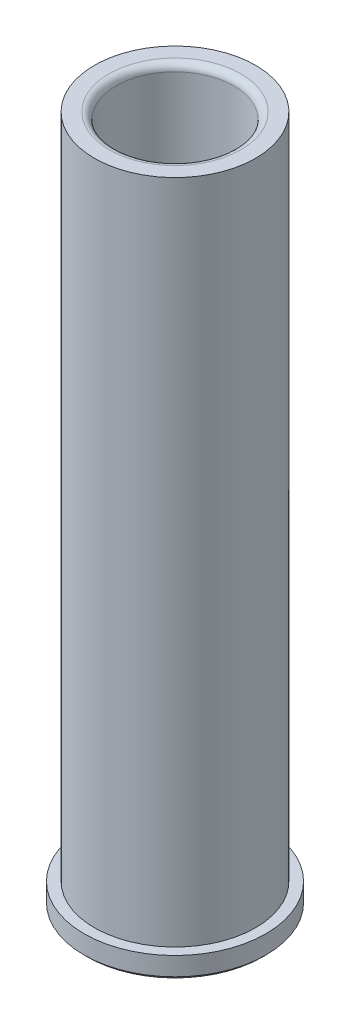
ISO-10303-21;
HEADER;
FILE_DESCRIPTION(('STEP AP214'),'2;1');
FILE_NAME('part.step','',(''),(''),'','','');
FILE_SCHEMA(('AUTOMOTIVE_DESIGN { 1 0 10303 214 1 1 1 1 }'));
ENDSEC;
DATA;
#1=APPLICATION_CONTEXT('core data for automotive mechanical design processes');
#2=APPLICATION_PROTOCOL_DEFINITION('international standard','automotive_design',2000,#1);
#3=PRODUCT_CONTEXT('',#1,'mechanical');
#4=PRODUCT('Part','Part','',(#3));
#5=PRODUCT_RELATED_PRODUCT_CATEGORY('part','',(#4));
#6=PRODUCT_DEFINITION_FORMATION('','',#4);
#7=PRODUCT_DEFINITION_CONTEXT('part definition',#1,'design');
#8=PRODUCT_DEFINITION('design','',#6,#7);
#9=PRODUCT_DEFINITION_SHAPE('','',#8);
#10=(LENGTH_UNIT() NAMED_UNIT(*) SI_UNIT(.MILLI.,.METRE.));
#11=(NAMED_UNIT(*) PLANE_ANGLE_UNIT() SI_UNIT($,.RADIAN.));
#12=(NAMED_UNIT(*) SI_UNIT($,.STERADIAN.) SOLID_ANGLE_UNIT());
#13=UNCERTAINTY_MEASURE_WITH_UNIT(LENGTH_MEASURE(1.E-05),#10,'distance_accuracy_value','');
#14=(GEOMETRIC_REPRESENTATION_CONTEXT(3) GLOBAL_UNCERTAINTY_ASSIGNED_CONTEXT((#13)) GLOBAL_UNIT_ASSIGNED_CONTEXT((#10,
#11,#12)) REPRESENTATION_CONTEXT('',''));
#15=CARTESIAN_POINT('',(0.,0.,0.));
#16=DIRECTION('',(0.,0.,1.));
#17=DIRECTION('',(1.,0.,0.));
#18=AXIS2_PLACEMENT_3D('',#15,#16,#17);
#19=CARTESIAN_POINT('',(3.49148336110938E-12,-1000.,0.));
#20=DIRECTION('',(0.,-1.,0.));
#21=DIRECTION('',(1.,0.,0.));
#22=AXIS2_PLACEMENT_3D('',#19,#20,#21);
#23=CYLINDRICAL_SURFACE('',#22,17.4688499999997);
#24=CARTESIAN_POINT('',(0.,4.7625,0.));
#25=DIRECTION('',(0.,-1.,0.));
#26=DIRECTION('',(1.,0.,0.));
#27=AXIS2_PLACEMENT_3D('',#24,#25,#26);
#28=CIRCLE('',#27,17.46885);
#29=CARTESIAN_POINT('',(17.4688499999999,4.76250000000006,0.));
#30=VERTEX_POINT('',#29);
#31=EDGE_CURVE('E60',#30,#30,#28,.T.);
#32=ORIENTED_EDGE('',*,*,#31,.F.);
#33=EDGE_LOOP('',(#32));
#34=FACE_BOUND('',#33,.T.);
#35=CARTESIAN_POINT('',(-5.21016604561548E-13,149.225,0.));
#36=DIRECTION('',(0.,-1.,0.));
#37=DIRECTION('',(1.,0.,0.));
#38=AXIS2_PLACEMENT_3D('',#35,#36,#37);
#39=CIRCLE('',#38,17.4688499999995);
#40=CARTESIAN_POINT('',(17.468849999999,149.225,0.));
#41=VERTEX_POINT('',#40);
#42=EDGE_CURVE('E39',#41,#41,#39,.T.);
#43=ORIENTED_EDGE('',*,*,#42,.T.);
#44=EDGE_LOOP('',(#43));
#45=FACE_BOUND('',#44,.T.);
#46=ADVANCED_FACE('F28',(#34,#45),#23,.T.);
#47=CARTESIAN_POINT('',(-17.46885,149.225,0.));
#48=DIRECTION('',(0.,-1.,0.));
#49=DIRECTION('',(1.,0.,0.));
#50=AXIS2_PLACEMENT_3D('',#47,#48,#49);
#51=PLANE('',#50);
#52=CARTESIAN_POINT('',(-5.21016604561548E-13,149.225,0.));
#53=DIRECTION('',(0.,-1.,0.));
#54=DIRECTION('',(1.,0.,0.));
#55=AXIS2_PLACEMENT_3D('',#52,#53,#54);
#56=CIRCLE('',#55,14.2874999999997);
#57=CARTESIAN_POINT('',(14.2874999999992,149.225,0.));
#58=VERTEX_POINT('',#57);
#59=EDGE_CURVE('E35',#58,#58,#56,.T.);
#60=ORIENTED_EDGE('',*,*,#59,.T.);
#61=EDGE_LOOP('',(#60));
#62=FACE_BOUND('',#61,.T.);
#63=ORIENTED_EDGE('',*,*,#42,.F.);
#64=EDGE_LOOP('',(#63));
#65=FACE_BOUND('',#64,.T.);
#66=ADVANCED_FACE('F68',(#62,#65),#51,.F.);
#67=CARTESIAN_POINT('',(3.49148336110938E-12,-1000.,0.));
#68=DIRECTION('',(0.,-1.,0.));
#69=DIRECTION('',(1.,0.,0.));
#70=AXIS2_PLACEMENT_3D('',#67,#68,#69);
#71=CYLINDRICAL_SURFACE('',#70,12.7634999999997);
#72=CARTESIAN_POINT('',(-5.15695583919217E-13,147.701,0.));
#73=DIRECTION('',(0.,-1.,0.));
#74=DIRECTION('',(1.,0.,0.));
#75=AXIS2_PLACEMENT_3D('',#72,#73,#74);
#76=CIRCLE('',#75,12.7634999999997);
#77=CARTESIAN_POINT('',(12.7634999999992,147.701,0.));
#78=VERTEX_POINT('',#77);
#79=EDGE_CURVE('E10',#78,#78,#76,.F.);
#80=ORIENTED_EDGE('',*,*,#79,.T.);
#81=EDGE_LOOP('',(#80));
#82=FACE_BOUND('',#81,.T.);
#83=CARTESIAN_POINT('',(0.,0.761999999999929,0.));
#84=DIRECTION('',(0.,-1.,0.));
#85=DIRECTION('',(1.,0.,0.));
#86=AXIS2_PLACEMENT_3D('',#83,#84,#85);
#87=CIRCLE('',#86,12.7635);
#88=CARTESIAN_POINT('',(12.7635,0.761999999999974,0.));
#89=VERTEX_POINT('',#88);
#90=EDGE_CURVE('E43',#89,#89,#87,.T.);
#91=ORIENTED_EDGE('',*,*,#90,.T.);
#92=EDGE_LOOP('',(#91));
#93=FACE_BOUND('',#92,.T.);
#94=ADVANCED_FACE('F72',(#82,#93),#71,.F.);
#95=CARTESIAN_POINT('',(0.,0.,0.));
#96=DIRECTION('',(0.,-1.,0.));
#97=DIRECTION('',(1.,0.,0.));
#98=AXIS2_PLACEMENT_3D('',#95,#96,#97);
#99=CONICAL_SURFACE('',#98,13.5255,0.785398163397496);
#100=ORIENTED_EDGE('',*,*,#90,.F.);
#101=EDGE_LOOP('',(#100));
#102=FACE_BOUND('',#101,.T.);
#103=CARTESIAN_POINT('',(0.,0.,0.));
#104=DIRECTION('',(0.,-1.,0.));
#105=DIRECTION('',(1.,0.,0.));
#106=AXIS2_PLACEMENT_3D('',#103,#104,#105);
#107=CIRCLE('',#106,13.5255);
#108=CARTESIAN_POINT('',(13.5255,0.,0.));
#109=VERTEX_POINT('',#108);
#110=EDGE_CURVE('E48',#109,#109,#107,.T.);
#111=ORIENTED_EDGE('',*,*,#110,.T.);
#112=EDGE_LOOP('',(#111));
#113=FACE_BOUND('',#112,.T.);
#114=ADVANCED_FACE('F77',(#102,#113),#99,.F.);
#115=CARTESIAN_POINT('',(-13.5255,0.,0.));
#116=DIRECTION('',(0.,1.,0.));
#117=DIRECTION('',(-1.,0.,0.));
#118=AXIS2_PLACEMENT_3D('',#115,#116,#117);
#119=PLANE('',#118);
#120=ORIENTED_EDGE('',*,*,#110,.F.);
#121=EDGE_LOOP('',(#120));
#122=FACE_BOUND('',#121,.T.);
#123=CARTESIAN_POINT('',(0.,0.,0.));
#124=DIRECTION('',(0.,-1.,0.));
#125=DIRECTION('',(1.,0.,0.));
#126=AXIS2_PLACEMENT_3D('',#123,#124,#125);
#127=CIRCLE('',#126,18.9484);
#128=CARTESIAN_POINT('',(18.9484,0.,0.));
#129=VERTEX_POINT('',#128);
#130=EDGE_CURVE('E51',#129,#129,#127,.T.);
#131=ORIENTED_EDGE('',*,*,#130,.T.);
#132=EDGE_LOOP('',(#131));
#133=FACE_BOUND('',#132,.T.);
#134=ADVANCED_FACE('F82',(#122,#133),#119,.F.);
#135=CARTESIAN_POINT('',(0.,0.761999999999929,0.));
#136=DIRECTION('',(0.,1.,0.));
#137=DIRECTION('',(-1.,0.,0.));
#138=AXIS2_PLACEMENT_3D('',#135,#136,#137);
#139=CONICAL_SURFACE('',#138,19.7104,0.785398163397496);
#140=ORIENTED_EDGE('',*,*,#130,.F.);
#141=EDGE_LOOP('',(#140));
#142=FACE_BOUND('',#141,.T.);
#143=CARTESIAN_POINT('',(0.,0.761999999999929,0.));
#144=DIRECTION('',(0.,-1.,0.));
#145=DIRECTION('',(1.,0.,0.));
#146=AXIS2_PLACEMENT_3D('',#143,#144,#145);
#147=CIRCLE('',#146,19.7104);
#148=CARTESIAN_POINT('',(19.7104,0.761999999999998,0.));
#149=VERTEX_POINT('',#148);
#150=EDGE_CURVE('E54',#149,#149,#147,.T.);
#151=ORIENTED_EDGE('',*,*,#150,.T.);
#152=EDGE_LOOP('',(#151));
#153=FACE_BOUND('',#152,.T.);
#154=ADVANCED_FACE('F86',(#142,#153),#139,.T.);
#155=CARTESIAN_POINT('',(3.49148336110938E-12,-1000.,0.));
#156=DIRECTION('',(0.,-1.,0.));
#157=DIRECTION('',(1.,0.,0.));
#158=AXIS2_PLACEMENT_3D('',#155,#156,#157);
#159=CYLINDRICAL_SURFACE('',#158,19.7104);
#160=ORIENTED_EDGE('',*,*,#150,.F.);
#161=EDGE_LOOP('',(#160));
#162=FACE_BOUND('',#161,.T.);
#163=CARTESIAN_POINT('',(0.,4.7625,0.));
#164=DIRECTION('',(0.,-1.,0.));
#165=DIRECTION('',(1.,0.,0.));
#166=AXIS2_PLACEMENT_3D('',#163,#164,#165);
#167=CIRCLE('',#166,19.7104);
#168=CARTESIAN_POINT('',(19.7104,4.76250000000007,0.));
#169=VERTEX_POINT('',#168);
#170=EDGE_CURVE('E57',#169,#169,#167,.T.);
#171=ORIENTED_EDGE('',*,*,#170,.T.);
#172=EDGE_LOOP('',(#171));
#173=FACE_BOUND('',#172,.T.);
#174=ADVANCED_FACE('F90',(#162,#173),#159,.T.);
#175=CARTESIAN_POINT('',(-19.7104,4.76249999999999,0.));
#176=DIRECTION('',(0.,-1.,0.));
#177=DIRECTION('',(1.,0.,0.));
#178=AXIS2_PLACEMENT_3D('',#175,#176,#177);
#179=PLANE('',#178);
#180=ORIENTED_EDGE('',*,*,#170,.F.);
#181=EDGE_LOOP('',(#180));
#182=FACE_BOUND('',#181,.T.);
#183=ORIENTED_EDGE('',*,*,#31,.T.);
#184=EDGE_LOOP('',(#183));
#185=FACE_BOUND('',#184,.T.);
#186=ADVANCED_FACE('F64',(#182,#185),#179,.F.);
#187=CARTESIAN_POINT('',(-5.15695583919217E-13,147.701,0.));
#188=DIRECTION('',(0.,-1.,0.));
#189=DIRECTION('',(1.,0.,0.));
#190=AXIS2_PLACEMENT_3D('',#187,#188,#189);
#191=TOROIDAL_SURFACE('',#190,14.2874999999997,1.524);
#192=ORIENTED_EDGE('',*,*,#79,.F.);
#193=EDGE_LOOP('',(#192));
#194=FACE_BOUND('',#193,.T.);
#195=ORIENTED_EDGE('',*,*,#59,.F.);
#196=EDGE_LOOP('',(#195));
#197=FACE_BOUND('',#196,.T.);
#198=ADVANCED_FACE('F30',(#194,#197),#191,.T.);
#199=CLOSED_SHELL('',(#46,#66,#94,#114,#134,#154,#174,#186,#198));
#200=MANIFOLD_SOLID_BREP('B2',#199);
#201=ADVANCED_BREP_SHAPE_REPRESENTATION('',(#18,#200),#14);
#202=SHAPE_DEFINITION_REPRESENTATION(#9,#201);
ENDSEC;
END-ISO-10303-21;
